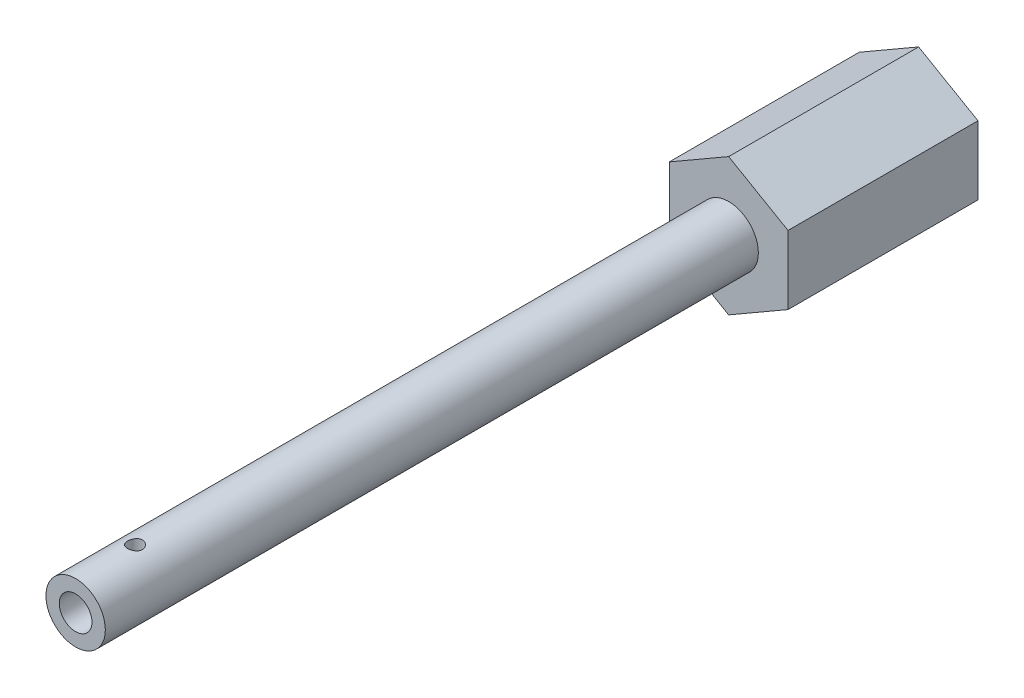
from build123d import *

# Parameters (mm, degrees)
BOSS_EXTRUDE1_DEPTH            = 20.32
SKETCH2_R                      = 3.175
BOSS_EXTRUDE2_DEPTH            = 69.85
F_3_5_3_5_DIAMETER_HOLE1_D     = 3.5
F_3_5_3_5_DIAMETER_HOLE1_DEPTH = 25.4
F_3_5_3_5_DIAMETER_HOLE1_TIP   = 1.051506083
F_1_16_0_0625_DIAMETER_HOLE1_D = 1.5875


with BuildPart() as part:
    # Sketch1 → Boss-Extrude1 (new body)
    with BuildSketch(Plane.XY):
        Polygon((0, 7.332348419), (-6.35, 3.666174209), (-6.35, -3.666174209), (0, -7.332348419), (6.35, -3.666174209), (6.35, 3.666174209), align=None)
    extrude(amount=BOSS_EXTRUDE1_DEPTH)

    # Sketch2 → Boss-Extrude2 (add)
    with BuildSketch(Plane.XY.offset(20.32)):
        Circle(SKETCH2_R)
    extrude(amount=BOSS_EXTRUDE2_DEPTH)

    # 3.5 _3.5_ Diameter Hole1
    with Locations(Plane.XY.offset(90.17)):
        with Locations((0, 0)):
            Hole(F_3_5_3_5_DIAMETER_HOLE1_D / 2, depth=F_3_5_3_5_DIAMETER_HOLE1_DEPTH)
            with Locations((0, 0, -(F_3_5_3_5_DIAMETER_HOLE1_DEPTH + F_3_5_3_5_DIAMETER_HOLE1_TIP / 2))):  # 118° drill point
                Cone(0, F_3_5_3_5_DIAMETER_HOLE1_D / 2, F_3_5_3_5_DIAMETER_HOLE1_TIP, mode=Mode.SUBTRACT)

    # 1_16 _0.0625_ Diameter Hole1 (through all)
    with Locations(Plane(origin=(0, 7.62, 0), x_dir=(1, 0, 0), z_dir=(0, 1, 0))):
        with Locations((0, -83.82)):
            Hole(F_1_16_0_0625_DIAMETER_HOLE1_D / 2)


solid = part.part
